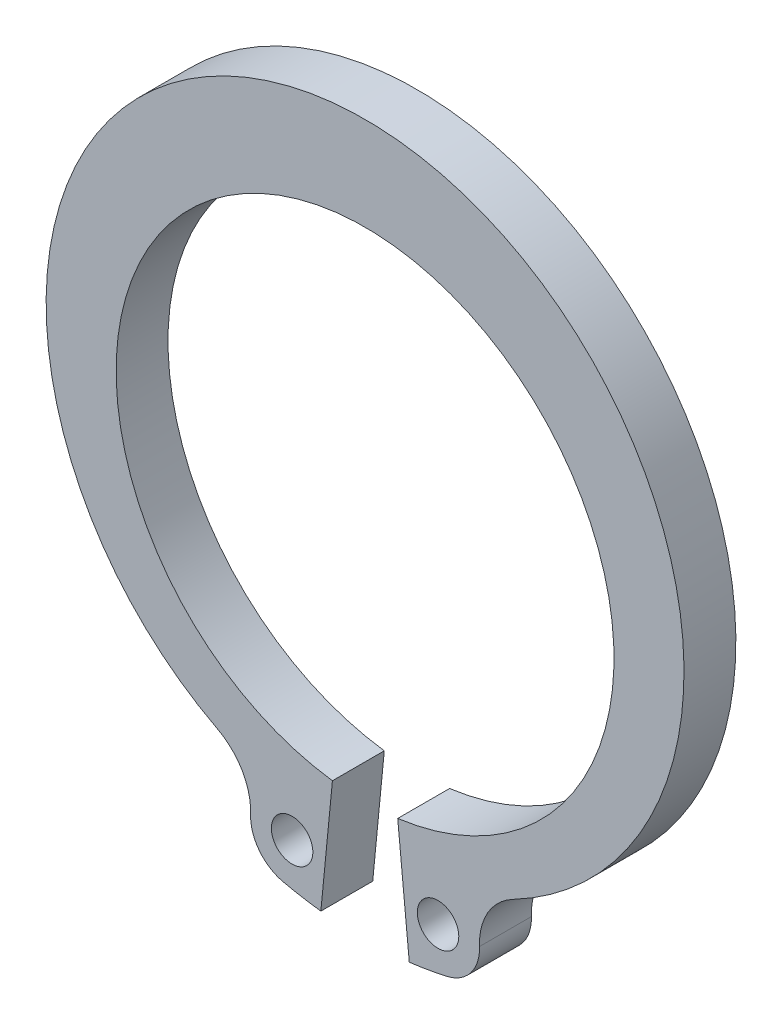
from build123d import *

# Parameters (mm, degrees)
ESQUISSE1_R          = 0.4
BASE_EXTRUSION_DEPTH = 1


with BuildPart() as part:
    # Esquisse1 → Base-Extrusion (new body)
    with BuildSketch(Plane.XY):
        with BuildLine():
            Line((0.629452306, -4.758549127), (0.852429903, -7.04771513))
            ThreePointArc((0.852429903, -7.04771513), (1.220759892, -6.993330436), (1.585731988, -6.919709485))
            ThreePointArc((1.585731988, -6.919709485), (2.042139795, -6.626381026), (2.206449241, -6.109320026))
            ThreePointArc((2.206449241, -6.109320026), (2.367413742, -5.461560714), (2.849559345, -5.000001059))
            ThreePointArc((2.849559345, -5.000001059), (0, 6.6), (-2.849559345, -5.000001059))
            ThreePointArc((-2.849559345, -5.000001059), (-2.367413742, -5.461560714), (-2.206449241, -6.109320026))
            ThreePointArc((-2.206449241, -6.109320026), (-2.042139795, -6.626381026), (-1.585731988, -6.919709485))
            ThreePointArc((-1.585731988, -6.919709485), (-1.220759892, -6.993330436), (-0.852429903, -7.04771513))
            Line((-0.852429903, -7.04771513), (-0.629452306, -4.758549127))
            ThreePointArc((-0.629452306, -4.758549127), (0, 4.8), (0.629452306, -4.758549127))
        make_face()
        with Locations((1.407034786, -6.139922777)):
            Circle(ESQUISSE1_R, mode=Mode.SUBTRACT)
        with Locations(Location((-1.407034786, -6.139922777, 0), (0, 0, 180))):
            Circle(ESQUISSE1_R, mode=Mode.SUBTRACT)
    extrude(amount=BASE_EXTRUSION_DEPTH)


solid = part.part
